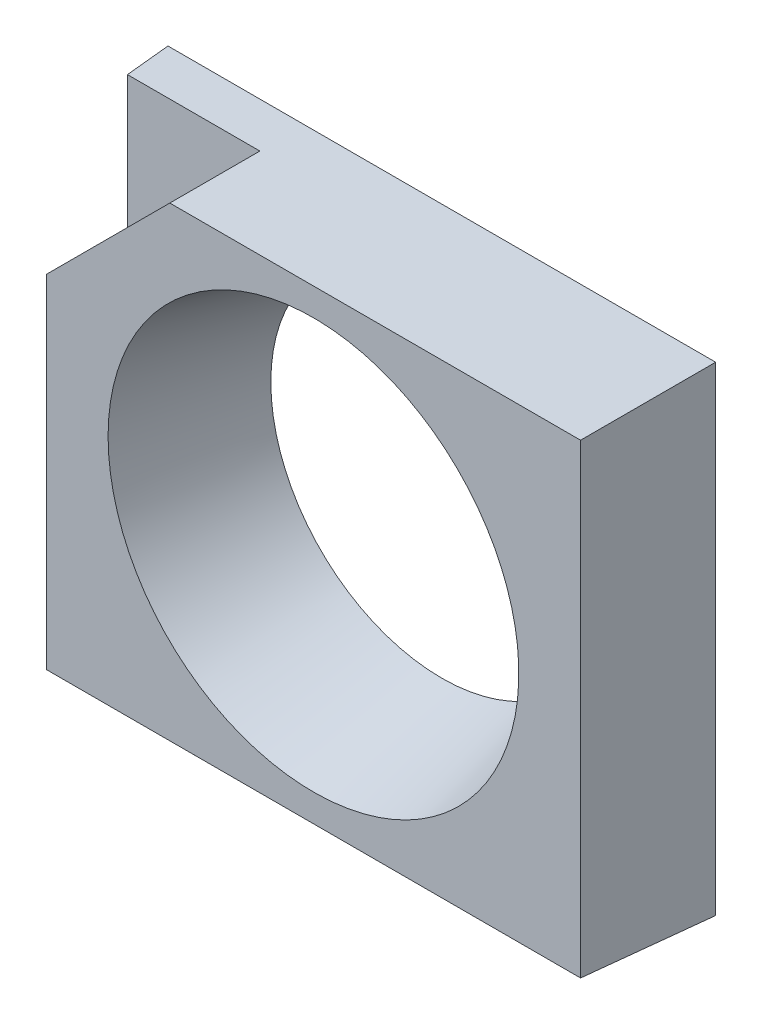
ISO-10303-21;
HEADER;
FILE_DESCRIPTION(('STEP AP214'),'2;1');
FILE_NAME('part.step','',(''),(''),'','','');
FILE_SCHEMA(('AUTOMOTIVE_DESIGN { 1 0 10303 214 1 1 1 1 }'));
ENDSEC;
DATA;
#1=APPLICATION_CONTEXT('core data for automotive mechanical design processes');
#2=APPLICATION_PROTOCOL_DEFINITION('international standard','automotive_design',2000,#1);
#3=PRODUCT_CONTEXT('',#1,'mechanical');
#4=PRODUCT('Part','Part','',(#3));
#5=PRODUCT_RELATED_PRODUCT_CATEGORY('part','',(#4));
#6=PRODUCT_DEFINITION_FORMATION('','',#4);
#7=PRODUCT_DEFINITION_CONTEXT('part definition',#1,'design');
#8=PRODUCT_DEFINITION('design','',#6,#7);
#9=PRODUCT_DEFINITION_SHAPE('','',#8);
#10=(LENGTH_UNIT() NAMED_UNIT(*) SI_UNIT(.MILLI.,.METRE.));
#11=(NAMED_UNIT(*) PLANE_ANGLE_UNIT() SI_UNIT($,.RADIAN.));
#12=(NAMED_UNIT(*) SI_UNIT($,.STERADIAN.) SOLID_ANGLE_UNIT());
#13=UNCERTAINTY_MEASURE_WITH_UNIT(LENGTH_MEASURE(1.E-05),#10,'distance_accuracy_value','');
#14=(GEOMETRIC_REPRESENTATION_CONTEXT(3) GLOBAL_UNCERTAINTY_ASSIGNED_CONTEXT((#13)) GLOBAL_UNIT_ASSIGNED_CONTEXT((#10,
#11,#12)) REPRESENTATION_CONTEXT('',''));
#15=CARTESIAN_POINT('',(0.,0.,0.));
#16=DIRECTION('',(0.,0.,1.));
#17=DIRECTION('',(1.,0.,0.));
#18=AXIS2_PLACEMENT_3D('',#15,#16,#17);
#19=CARTESIAN_POINT('',(0.,0.,1.9));
#20=DIRECTION('',(0.,0.,1.));
#21=DIRECTION('',(1.,0.,0.));
#22=AXIS2_PLACEMENT_3D('',#19,#20,#21);
#23=CONICAL_SURFACE('',#22,1.2,0.261799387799);
#24=CARTESIAN_POINT('',(-0.999038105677,0.,1.15));
#25=CARTESIAN_POINT('',(-1.2,0.,1.9));
#26=(BOUNDED_CURVE() B_SPLINE_CURVE(1,(#24,#25),.UNSPECIFIED.,.F.,
.F.) B_SPLINE_CURVE_WITH_KNOTS((2,2),(-0.776457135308,0.),
.UNSPECIFIED.) CURVE() GEOMETRIC_REPRESENTATION_ITEM() RATIONAL_B_SPLINE_CURVE((1.,1.)) REPRESENTATION_ITEM(''));
#27=CARTESIAN_POINT('',(-0.999038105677,0.,1.15));
#28=VERTEX_POINT('',#27);
#29=CARTESIAN_POINT('',(-1.2,0.,1.9));
#30=VERTEX_POINT('',#29);
#31=EDGE_CURVE('E11',#28,#30,#26,.T.);
#32=ORIENTED_EDGE('',*,*,#31,.T.);
#33=CARTESIAN_POINT('',(0.,0.,1.9));
#34=DIRECTION('',(0.,0.,-1.));
#35=DIRECTION('',(-1.,0.,0.));
#36=AXIS2_PLACEMENT_3D('',#33,#34,#35);
#37=CIRCLE('',#36,1.2);
#38=EDGE_CURVE('E94',#30,#30,#37,.T.);
#39=ORIENTED_EDGE('',*,*,#38,.F.);
#40=ORIENTED_EDGE('',*,*,#31,.F.);
#41=CARTESIAN_POINT('',(0.,0.,1.15));
#42=DIRECTION('',(0.,0.,-1.));
#43=DIRECTION('',(-1.,0.,0.));
#44=AXIS2_PLACEMENT_3D('',#41,#42,#43);
#45=CIRCLE('',#44,0.999038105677);
#46=EDGE_CURVE('E96',#28,#28,#45,.T.);
#47=ORIENTED_EDGE('',*,*,#46,.T.);
#48=EDGE_LOOP('',(#32,#39,#40,#47));
#49=FACE_BOUND('',#48,.T.);
#50=ADVANCED_FACE('F17',(#49),#23,.F.);
#51=CARTESIAN_POINT('',(-1.6,0.6,1.4));
#52=DIRECTION('',(0.,0.,-1.));
#53=DIRECTION('',(0.,-1.,0.));
#54=AXIS2_PLACEMENT_3D('',#51,#52,#53);
#55=PLANE('',#54);
#56=DIRECTION('',(-0.707106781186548,-0.707106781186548,0.));
#57=VECTOR('',#56,1.);
#58=CARTESIAN_POINT('',(-0.8,1.4,1.4));
#59=LINE('',#58,#57);
#60=CARTESIAN_POINT('',(-0.813101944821,1.386898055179,1.4));
#61=VERTEX_POINT('',#60);
#62=CARTESIAN_POINT('',(-1.586898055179,0.613101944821,1.4));
#63=VERTEX_POINT('',#62);
#64=EDGE_CURVE('E136',#61,#63,#59,.T.);
#65=ORIENTED_EDGE('',*,*,#64,.F.);
#66=DIRECTION('',(-1.,0.,0.));
#67=VECTOR('',#66,1.);
#68=CARTESIAN_POINT('',(0.,1.386898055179,1.4));
#69=LINE('',#68,#67);
#70=CARTESIAN_POINT('',(-1.586898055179,1.386898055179,1.4));
#71=VERTEX_POINT('',#70);
#72=EDGE_CURVE('E153',#61,#71,#69,.T.);
#73=ORIENTED_EDGE('',*,*,#72,.T.);
#74=DIRECTION('',(0.,-1.,0.));
#75=VECTOR('',#74,1.);
#76=CARTESIAN_POINT('',(-1.586898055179,0.,1.4));
#77=LINE('',#76,#75);
#78=EDGE_CURVE('E132',#71,#63,#77,.T.);
#79=ORIENTED_EDGE('',*,*,#78,.T.);
#80=EDGE_LOOP('',(#65,#73,#79));
#81=FACE_BOUND('',#80,.T.);
#82=ADVANCED_FACE('F19',(#81),#55,.F.);
#83=CARTESIAN_POINT('',(0.,-1.4,1.15));
#84=DIRECTION('',(0.,-0.998629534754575,0.0523359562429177));
#85=DIRECTION('',(-1.,0.,0.));
#86=AXIS2_PLACEMENT_3D('',#83,#84,#85);
#87=PLANE('',#86);
#88=DIRECTION('',(-1.,0.,0.));
#89=VECTOR('',#88,1.);
#90=CARTESIAN_POINT('',(0.,-1.4,1.15));
#91=LINE('',#90,#89);
#92=CARTESIAN_POINT('',(1.6,-1.4,1.15));
#93=VERTEX_POINT('',#92);
#94=CARTESIAN_POINT('',(-1.6,-1.4,1.15));
#95=VERTEX_POINT('',#94);
#96=EDGE_CURVE('E163',#93,#95,#91,.T.);
#97=ORIENTED_EDGE('',*,*,#96,.F.);
#98=DIRECTION('',(0.0522644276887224,-0.0522644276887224,-0.997264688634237));
#99=VECTOR('',#98,1.);
#100=CARTESIAN_POINT('',(1.596175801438,-1.396175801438,1.222970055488));
#101=LINE('',#100,#99);
#102=CARTESIAN_POINT('',(1.560694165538,-1.360694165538,1.9));
#103=VERTEX_POINT('',#102);
#104=EDGE_CURVE('E28',#103,#93,#101,.T.);
#105=ORIENTED_EDGE('',*,*,#104,.F.);
#106=DIRECTION('',(-1.,0.,0.));
#107=VECTOR('',#106,1.);
#108=CARTESIAN_POINT('',(0.,-1.360694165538,1.9));
#109=LINE('',#108,#107);
#110=CARTESIAN_POINT('',(-1.560694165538,-1.360694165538,1.9));
#111=VERTEX_POINT('',#110);
#112=EDGE_CURVE('E115',#103,#111,#109,.T.);
#113=ORIENTED_EDGE('',*,*,#112,.T.);
#114=DIRECTION('',(-0.0522644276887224,-0.0522644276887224,-0.997264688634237));
#115=VECTOR('',#114,1.);
#116=CARTESIAN_POINT('',(-1.595629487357,-1.395629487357,1.233394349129));
#117=LINE('',#116,#115);
#118=EDGE_CURVE('E120',#111,#95,#117,.T.);
#119=ORIENTED_EDGE('',*,*,#118,.T.);
#120=EDGE_LOOP('',(#97,#105,#113,#119));
#121=FACE_BOUND('',#120,.T.);
#122=ADVANCED_FACE('F239',(#121),#87,.T.);
#123=CARTESIAN_POINT('',(1.6,0.,1.15));
#124=DIRECTION('',(0.998629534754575,0.,0.0523359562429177));
#125=DIRECTION('',(0.,-1.,0.));
#126=AXIS2_PLACEMENT_3D('',#123,#124,#125);
#127=PLANE('',#126);
#128=DIRECTION('',(0.,-1.,0.));
#129=VECTOR('',#128,1.);
#130=CARTESIAN_POINT('',(1.6,0.,1.15));
#131=LINE('',#130,#129);
#132=CARTESIAN_POINT('',(1.6,1.4,1.15));
#133=VERTEX_POINT('',#132);
#134=EDGE_CURVE('E156',#133,#93,#131,.T.);
#135=ORIENTED_EDGE('',*,*,#134,.F.);
#136=DIRECTION('',(0.0522644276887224,0.0522644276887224,-0.997264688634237));
#137=VECTOR('',#136,1.);
#138=CARTESIAN_POINT('',(1.595629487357,1.395629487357,1.233394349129));
#139=LINE('',#138,#137);
#140=CARTESIAN_POINT('',(1.560694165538,1.360694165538,1.9));
#141=VERTEX_POINT('',#140);
#142=EDGE_CURVE('E148',#141,#133,#139,.T.);
#143=ORIENTED_EDGE('',*,*,#142,.F.);
#144=DIRECTION('',(0.,-1.,0.));
#145=VECTOR('',#144,1.);
#146=CARTESIAN_POINT('',(1.560694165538,0.,1.9));
#147=LINE('',#146,#145);
#148=EDGE_CURVE('E125',#141,#103,#147,.T.);
#149=ORIENTED_EDGE('',*,*,#148,.T.);
#150=ORIENTED_EDGE('',*,*,#104,.T.);
#151=EDGE_LOOP('',(#135,#143,#149,#150));
#152=FACE_BOUND('',#151,.T.);
#153=ADVANCED_FACE('F229',(#152),#127,.T.);
#154=CARTESIAN_POINT('',(-1.6,-1.4,1.15));
#155=DIRECTION('',(0.,0.,1.));
#156=DIRECTION('',(1.,0.,0.));
#157=AXIS2_PLACEMENT_3D('',#154,#155,#156);
#158=PLANE('',#157);
#159=ORIENTED_EDGE('',*,*,#46,.F.);
#160=EDGE_LOOP('',(#159));
#161=FACE_BOUND('',#160,.T.);
#162=DIRECTION('',(0.,1.,0.));
#163=VECTOR('',#162,1.);
#164=CARTESIAN_POINT('',(-1.6,0.,1.15));
#165=LINE('',#164,#163);
#166=CARTESIAN_POINT('',(-1.6,1.4,1.15));
#167=VERTEX_POINT('',#166);
#168=EDGE_CURVE('E116',#95,#167,#165,.T.);
#169=ORIENTED_EDGE('',*,*,#168,.T.);
#170=DIRECTION('',(1.,0.,0.));
#171=VECTOR('',#170,1.);
#172=CARTESIAN_POINT('',(0.,1.4,1.15));
#173=LINE('',#172,#171);
#174=EDGE_CURVE('E149',#167,#133,#173,.T.);
#175=ORIENTED_EDGE('',*,*,#174,.T.);
#176=ORIENTED_EDGE('',*,*,#134,.T.);
#177=ORIENTED_EDGE('',*,*,#96,.T.);
#178=EDGE_LOOP('',(#169,#175,#176,#177));
#179=FACE_BOUND('',#178,.T.);
#180=ADVANCED_FACE('F219',(#161,#179),#158,.F.);
#181=CARTESIAN_POINT('',(0.,1.4,1.15));
#182=DIRECTION('',(0.,0.998629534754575,0.0523359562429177));
#183=DIRECTION('',(1.,0.,0.));
#184=AXIS2_PLACEMENT_3D('',#181,#182,#183);
#185=PLANE('',#184);
#186=DIRECTION('',(-0.0522644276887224,-0.0522644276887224,0.997264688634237));
#187=VECTOR('',#186,1.);
#188=CARTESIAN_POINT('',(-0.797814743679,1.402185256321,1.108302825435));
#189=LINE('',#188,#187);
#190=CARTESIAN_POINT('',(-0.839305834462,1.360694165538,1.9));
#191=VERTEX_POINT('',#190);
#192=EDGE_CURVE('E133',#61,#191,#189,.T.);
#193=ORIENTED_EDGE('',*,*,#192,.T.);
#194=DIRECTION('',(1.,0.,0.));
#195=VECTOR('',#194,1.);
#196=CARTESIAN_POINT('',(0.,1.360694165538,1.9));
#197=LINE('',#196,#195);
#198=EDGE_CURVE('E100',#191,#141,#197,.T.);
#199=ORIENTED_EDGE('',*,*,#198,.T.);
#200=ORIENTED_EDGE('',*,*,#142,.T.);
#201=ORIENTED_EDGE('',*,*,#174,.F.);
#202=DIRECTION('',(-0.0522644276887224,0.0522644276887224,-0.997264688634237));
#203=VECTOR('',#202,1.);
#204=CARTESIAN_POINT('',(-1.596175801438,1.396175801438,1.222970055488));
#205=LINE('',#204,#203);
#206=EDGE_CURVE('E121',#71,#167,#205,.T.);
#207=ORIENTED_EDGE('',*,*,#206,.F.);
#208=ORIENTED_EDGE('',*,*,#72,.F.);
#209=EDGE_LOOP('',(#193,#199,#200,#201,#207,#208));
#210=FACE_BOUND('',#209,.T.);
#211=ADVANCED_FACE('F209',(#210),#185,.T.);
#212=CARTESIAN_POINT('',(-0.8,1.4,1.4));
#213=DIRECTION('',(-0.707106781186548,0.707106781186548,0.));
#214=DIRECTION('',(0.,0.,1.));
#215=AXIS2_PLACEMENT_3D('',#212,#213,#214);
#216=PLANE('',#215);
#217=DIRECTION('',(-0.0522644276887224,-0.0522644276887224,-0.997264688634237));
#218=VECTOR('',#217,1.);
#219=CARTESIAN_POINT('',(-1.601638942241,0.598361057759,1.118727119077));
#220=LINE('',#219,#218);
#221=CARTESIAN_POINT('',(-1.560694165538,0.639305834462,1.9));
#222=VERTEX_POINT('',#221);
#223=EDGE_CURVE('E128',#222,#63,#220,.T.);
#224=ORIENTED_EDGE('',*,*,#223,.F.);
#225=DIRECTION('',(-0.707106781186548,-0.707106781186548,0.));
#226=VECTOR('',#225,1.);
#227=CARTESIAN_POINT('',(-0.8,1.4,1.9));
#228=LINE('',#227,#226);
#229=EDGE_CURVE('E105',#191,#222,#228,.T.);
#230=ORIENTED_EDGE('',*,*,#229,.F.);
#231=ORIENTED_EDGE('',*,*,#192,.F.);
#232=ORIENTED_EDGE('',*,*,#64,.T.);
#233=EDGE_LOOP('',(#224,#230,#231,#232));
#234=FACE_BOUND('',#233,.T.);
#235=ADVANCED_FACE('F191',(#234),#216,.T.);
#236=CARTESIAN_POINT('',(-1.6,0.,1.15));
#237=DIRECTION('',(-0.998629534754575,0.,0.0523359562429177));
#238=DIRECTION('',(0.,1.,0.));
#239=AXIS2_PLACEMENT_3D('',#236,#237,#238);
#240=PLANE('',#239);
#241=ORIENTED_EDGE('',*,*,#223,.T.);
#242=ORIENTED_EDGE('',*,*,#78,.F.);
#243=ORIENTED_EDGE('',*,*,#206,.T.);
#244=ORIENTED_EDGE('',*,*,#168,.F.);
#245=ORIENTED_EDGE('',*,*,#118,.F.);
#246=DIRECTION('',(0.,1.,0.));
#247=VECTOR('',#246,1.);
#248=CARTESIAN_POINT('',(-1.560694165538,0.,1.9));
#249=LINE('',#248,#247);
#250=EDGE_CURVE('E111',#111,#222,#249,.T.);
#251=ORIENTED_EDGE('',*,*,#250,.T.);
#252=EDGE_LOOP('',(#241,#242,#243,#244,#245,#251));
#253=FACE_BOUND('',#252,.T.);
#254=ADVANCED_FACE('F179',(#253),#240,.T.);
#255=CARTESIAN_POINT('',(-1.6,-1.4,1.9));
#256=DIRECTION('',(0.,0.,1.));
#257=DIRECTION('',(1.,0.,0.));
#258=AXIS2_PLACEMENT_3D('',#255,#256,#257);
#259=PLANE('',#258);
#260=ORIENTED_EDGE('',*,*,#198,.F.);
#261=ORIENTED_EDGE('',*,*,#229,.T.);
#262=ORIENTED_EDGE('',*,*,#250,.F.);
#263=ORIENTED_EDGE('',*,*,#112,.F.);
#264=ORIENTED_EDGE('',*,*,#148,.F.);
#265=EDGE_LOOP('',(#260,#261,#262,#263,#264));
#266=FACE_BOUND('',#265,.T.);
#267=ORIENTED_EDGE('',*,*,#38,.T.);
#268=EDGE_LOOP('',(#267));
#269=FACE_BOUND('',#268,.T.);
#270=ADVANCED_FACE('F98',(#266,#269),#259,.T.);
#271=CLOSED_SHELL('',(#50,#82,#122,#153,#180,#211,#235,#254,#270));
#272=MANIFOLD_SOLID_BREP('B1',#271);
#273=ADVANCED_BREP_SHAPE_REPRESENTATION('',(#18,#272),#14);
#274=SHAPE_DEFINITION_REPRESENTATION(#9,#273);
ENDSEC;
END-ISO-10303-21;
